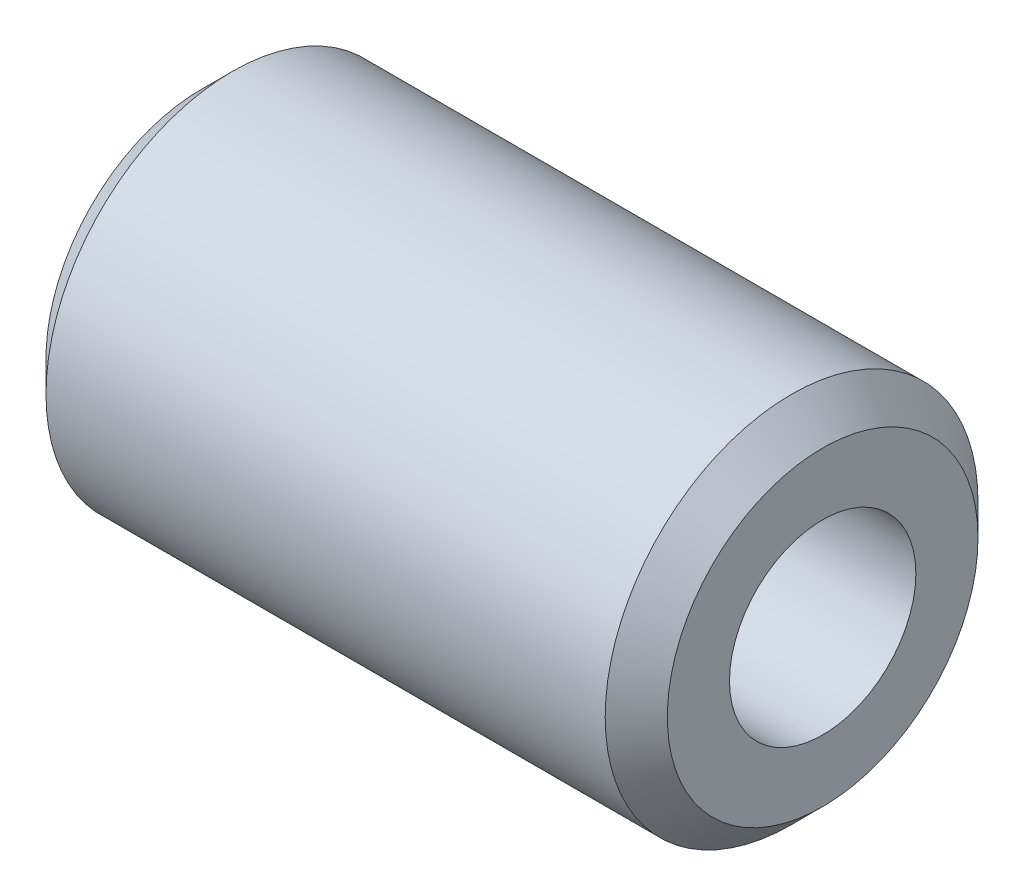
ISO-10303-21;
HEADER;
FILE_DESCRIPTION(('STEP AP214'),'2;1');
FILE_NAME('part.step','',(''),(''),'','','');
FILE_SCHEMA(('AUTOMOTIVE_DESIGN { 1 0 10303 214 1 1 1 1 }'));
ENDSEC;
DATA;
#1=APPLICATION_CONTEXT('core data for automotive mechanical design processes');
#2=APPLICATION_PROTOCOL_DEFINITION('international standard','automotive_design',2000,#1);
#3=PRODUCT_CONTEXT('',#1,'mechanical');
#4=PRODUCT('Part','Part','',(#3));
#5=PRODUCT_RELATED_PRODUCT_CATEGORY('part','',(#4));
#6=PRODUCT_DEFINITION_FORMATION('','',#4);
#7=PRODUCT_DEFINITION_CONTEXT('part definition',#1,'design');
#8=PRODUCT_DEFINITION('design','',#6,#7);
#9=PRODUCT_DEFINITION_SHAPE('','',#8);
#10=(LENGTH_UNIT() NAMED_UNIT(*) SI_UNIT(.MILLI.,.METRE.));
#11=(NAMED_UNIT(*) PLANE_ANGLE_UNIT() SI_UNIT($,.RADIAN.));
#12=(NAMED_UNIT(*) SI_UNIT($,.STERADIAN.) SOLID_ANGLE_UNIT());
#13=UNCERTAINTY_MEASURE_WITH_UNIT(LENGTH_MEASURE(1.E-05),#10,'distance_accuracy_value','');
#14=(GEOMETRIC_REPRESENTATION_CONTEXT(3) GLOBAL_UNCERTAINTY_ASSIGNED_CONTEXT((#13)) GLOBAL_UNIT_ASSIGNED_CONTEXT((#10,
#11,#12)) REPRESENTATION_CONTEXT('',''));
#15=CARTESIAN_POINT('',(0.,0.,0.));
#16=DIRECTION('',(0.,0.,1.));
#17=DIRECTION('',(1.,0.,0.));
#18=AXIS2_PLACEMENT_3D('',#15,#16,#17);
#19=CARTESIAN_POINT('',(20.,0.,0.));
#20=DIRECTION('',(-1.,0.,0.));
#21=DIRECTION('',(0.,0.,1.));
#22=AXIS2_PLACEMENT_3D('',#19,#20,#21);
#23=CYLINDRICAL_SURFACE('',#22,6.);
#24=CARTESIAN_POINT('',(19.,0.,0.));
#25=DIRECTION('',(1.,0.,0.));
#26=DIRECTION('',(0.,0.,-1.));
#27=AXIS2_PLACEMENT_3D('',#24,#25,#26);
#28=CIRCLE('',#27,6.);
#29=CARTESIAN_POINT('',(19.,0.,-6.));
#30=VERTEX_POINT('',#29);
#31=EDGE_CURVE('E48',#30,#30,#28,.F.);
#32=ORIENTED_EDGE('',*,*,#31,.T.);
#33=EDGE_LOOP('',(#32));
#34=FACE_BOUND('',#33,.T.);
#35=CARTESIAN_POINT('',(1.,0.,0.));
#36=DIRECTION('',(1.,0.,0.));
#37=DIRECTION('',(0.,0.,-1.));
#38=AXIS2_PLACEMENT_3D('',#35,#36,#37);
#39=CIRCLE('',#38,6.);
#40=CARTESIAN_POINT('',(1.,0.,-6.));
#41=VERTEX_POINT('',#40);
#42=EDGE_CURVE('E52',#41,#41,#39,.T.);
#43=ORIENTED_EDGE('',*,*,#42,.T.);
#44=EDGE_LOOP('',(#43));
#45=FACE_BOUND('',#44,.T.);
#46=ADVANCED_FACE('F41',(#34,#45),#23,.T.);
#47=CARTESIAN_POINT('',(20.,0.,0.));
#48=DIRECTION('',(1.,0.,0.));
#49=DIRECTION('',(0.,0.,-1.));
#50=AXIS2_PLACEMENT_3D('',#47,#48,#49);
#51=PLANE('',#50);
#52=CARTESIAN_POINT('',(20.,0.,0.));
#53=DIRECTION('',(1.,0.,0.));
#54=DIRECTION('',(0.,0.,-1.));
#55=AXIS2_PLACEMENT_3D('',#52,#53,#54);
#56=CIRCLE('',#55,3.);
#57=CARTESIAN_POINT('',(20.,0.,-3.));
#58=VERTEX_POINT('',#57);
#59=EDGE_CURVE('E66',#58,#58,#56,.T.);
#60=ORIENTED_EDGE('',*,*,#59,.F.);
#61=EDGE_LOOP('',(#60));
#62=FACE_BOUND('',#61,.T.);
#63=CARTESIAN_POINT('',(20.,0.,0.));
#64=DIRECTION('',(1.,0.,0.));
#65=DIRECTION('',(0.,0.,-1.));
#66=AXIS2_PLACEMENT_3D('',#63,#64,#65);
#67=CIRCLE('',#66,5.);
#68=CARTESIAN_POINT('',(20.,0.,-5.));
#69=VERTEX_POINT('',#68);
#70=EDGE_CURVE('E57',#69,#69,#67,.T.);
#71=ORIENTED_EDGE('',*,*,#70,.T.);
#72=EDGE_LOOP('',(#71));
#73=FACE_BOUND('',#72,.T.);
#74=ADVANCED_FACE('F72',(#62,#73),#51,.T.);
#75=CARTESIAN_POINT('',(0.,0.,0.));
#76=DIRECTION('',(1.,0.,0.));
#77=DIRECTION('',(0.,0.,-1.));
#78=AXIS2_PLACEMENT_3D('',#75,#76,#77);
#79=PLANE('',#78);
#80=CARTESIAN_POINT('',(0.,0.,0.));
#81=DIRECTION('',(1.,0.,0.));
#82=DIRECTION('',(0.,0.,-1.));
#83=AXIS2_PLACEMENT_3D('',#80,#81,#82);
#84=CIRCLE('',#83,4.99999999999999);
#85=CARTESIAN_POINT('',(0.,0.,-4.99999999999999));
#86=VERTEX_POINT('',#85);
#87=EDGE_CURVE('E12',#86,#86,#84,.F.);
#88=ORIENTED_EDGE('',*,*,#87,.T.);
#89=EDGE_LOOP('',(#88));
#90=FACE_BOUND('',#89,.T.);
#91=ADVANCED_FACE('F75',(#90),#79,.F.);
#92=CARTESIAN_POINT('',(20.,0.,0.));
#93=DIRECTION('',(-1.,0.,0.));
#94=DIRECTION('',(0.,0.,1.));
#95=AXIS2_PLACEMENT_3D('',#92,#93,#94);
#96=CONICAL_SURFACE('',#95,5.,0.785398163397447);
#97=ORIENTED_EDGE('',*,*,#31,.F.);
#98=EDGE_LOOP('',(#97));
#99=FACE_BOUND('',#98,.T.);
#100=ORIENTED_EDGE('',*,*,#70,.F.);
#101=EDGE_LOOP('',(#100));
#102=FACE_BOUND('',#101,.T.);
#103=ADVANCED_FACE('F78',(#99,#102),#96,.T.);
#104=CARTESIAN_POINT('',(1.,0.,0.));
#105=DIRECTION('',(1.,0.,0.));
#106=DIRECTION('',(0.,0.,-1.));
#107=AXIS2_PLACEMENT_3D('',#104,#105,#106);
#108=CONICAL_SURFACE('',#107,6.,0.78539816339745);
#109=ORIENTED_EDGE('',*,*,#87,.F.);
#110=EDGE_LOOP('',(#109));
#111=FACE_BOUND('',#110,.T.);
#112=ORIENTED_EDGE('',*,*,#42,.F.);
#113=EDGE_LOOP('',(#112));
#114=FACE_BOUND('',#113,.T.);
#115=ADVANCED_FACE('F80',(#111,#114),#108,.T.);
#116=CARTESIAN_POINT('',(8.,0.,0.));
#117=DIRECTION('',(1.,0.,0.));
#118=DIRECTION('',(0.,0.,-1.));
#119=AXIS2_PLACEMENT_3D('',#116,#117,#118);
#120=PLANE('',#119);
#121=CARTESIAN_POINT('',(8.,0.,0.));
#122=DIRECTION('',(1.,0.,0.));
#123=DIRECTION('',(0.,0.,-1.));
#124=AXIS2_PLACEMENT_3D('',#121,#122,#123);
#125=CIRCLE('',#124,3.);
#126=CARTESIAN_POINT('',(8.,0.,-3.));
#127=VERTEX_POINT('',#126);
#128=EDGE_CURVE('E63',#127,#127,#125,.T.);
#129=ORIENTED_EDGE('',*,*,#128,.T.);
#130=EDGE_LOOP('',(#129));
#131=FACE_BOUND('',#130,.T.);
#132=CARTESIAN_POINT('',(8.,0.,0.));
#133=DIRECTION('',(1.,0.,0.));
#134=DIRECTION('',(0.,0.,-1.));
#135=AXIS2_PLACEMENT_3D('',#132,#133,#134);
#136=CIRCLE('',#135,2.5);
#137=CARTESIAN_POINT('',(8.,0.,-2.5));
#138=VERTEX_POINT('',#137);
#139=EDGE_CURVE('E44',#138,#138,#136,.F.);
#140=ORIENTED_EDGE('',*,*,#139,.T.);
#141=EDGE_LOOP('',(#140));
#142=FACE_BOUND('',#141,.T.);
#143=ADVANCED_FACE('F87',(#131,#142),#120,.T.);
#144=CARTESIAN_POINT('',(8.,0.,0.));
#145=DIRECTION('',(1.,0.,0.));
#146=DIRECTION('',(0.,0.,-1.));
#147=AXIS2_PLACEMENT_3D('',#144,#145,#146);
#148=CYLINDRICAL_SURFACE('',#147,3.);
#149=ORIENTED_EDGE('',*,*,#128,.F.);
#150=EDGE_LOOP('',(#149));
#151=FACE_BOUND('',#150,.T.);
#152=ORIENTED_EDGE('',*,*,#59,.T.);
#153=EDGE_LOOP('',(#152));
#154=FACE_BOUND('',#153,.T.);
#155=ADVANCED_FACE('F70',(#151,#154),#148,.F.);
#156=CARTESIAN_POINT('',(5.,0.,0.));
#157=DIRECTION('',(1.,0.,0.));
#158=DIRECTION('',(0.,0.,-1.));
#159=AXIS2_PLACEMENT_3D('',#156,#157,#158);
#160=PLANE('',#159);
#161=CARTESIAN_POINT('',(5.,0.,0.));
#162=DIRECTION('',(1.,0.,0.));
#163=DIRECTION('',(0.,0.,-1.));
#164=AXIS2_PLACEMENT_3D('',#161,#162,#163);
#165=CIRCLE('',#164,2.5);
#166=CARTESIAN_POINT('',(5.,0.,-2.5));
#167=VERTEX_POINT('',#166);
#168=EDGE_CURVE('E60',#167,#167,#165,.T.);
#169=ORIENTED_EDGE('',*,*,#168,.T.);
#170=EDGE_LOOP('',(#169));
#171=FACE_BOUND('',#170,.T.);
#172=ADVANCED_FACE('F136',(#171),#160,.T.);
#173=CARTESIAN_POINT('',(5.,0.,0.));
#174=DIRECTION('',(1.,0.,0.));
#175=DIRECTION('',(0.,0.,-1.));
#176=AXIS2_PLACEMENT_3D('',#173,#174,#175);
#177=CYLINDRICAL_SURFACE('',#176,2.5);
#178=ORIENTED_EDGE('',*,*,#168,.F.);
#179=EDGE_LOOP('',(#178));
#180=FACE_BOUND('',#179,.T.);
#181=ORIENTED_EDGE('',*,*,#139,.F.);
#182=EDGE_LOOP('',(#181));
#183=FACE_BOUND('',#182,.T.);
#184=ADVANCED_FACE('F146',(#180,#183),#177,.F.);
#185=CLOSED_SHELL('',(#46,#74,#91,#103,#115,#143,#155,#172,#184));
#186=MANIFOLD_SOLID_BREP('B2',#185);
#187=ADVANCED_BREP_SHAPE_REPRESENTATION('',(#18,#186),#14);
#188=SHAPE_DEFINITION_REPRESENTATION(#9,#187);
ENDSEC;
END-ISO-10303-21;
